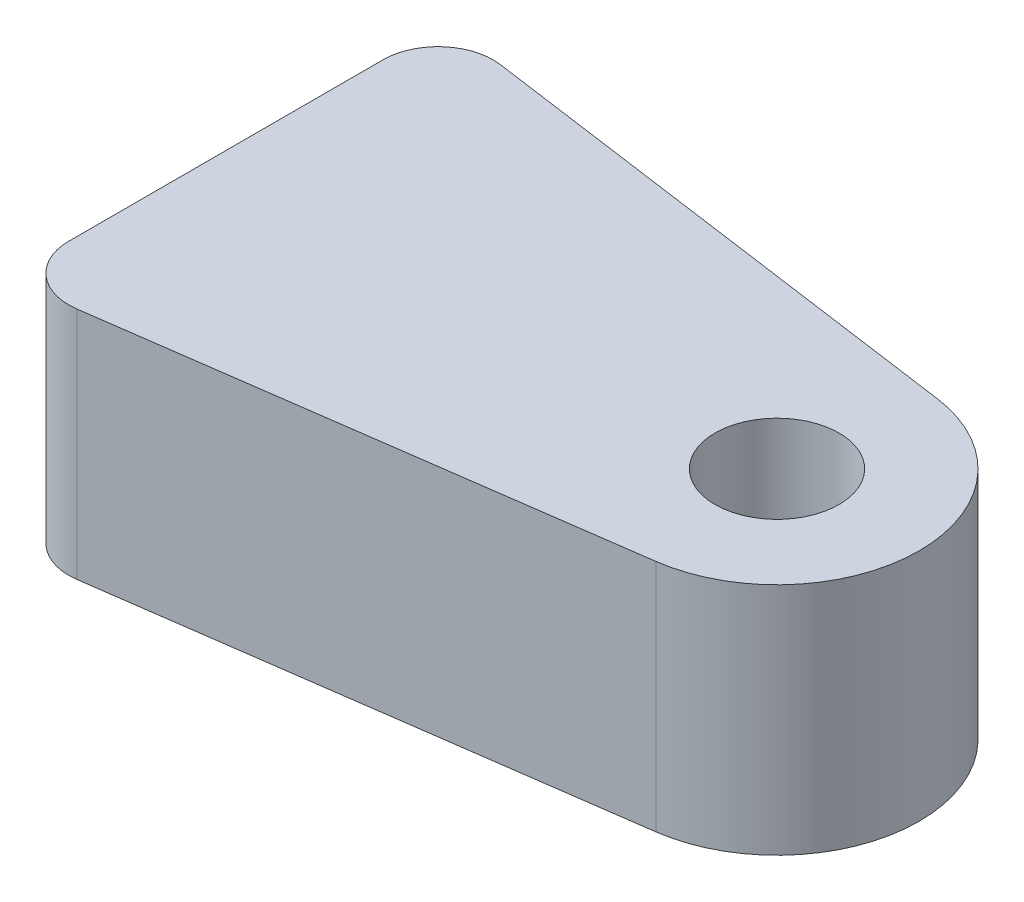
from build123d import *

# Parameters (mm, degrees)
ESQUISSE1_R             = 5.158029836
ESQUISSE1_R_2           = 2.45
BOSS_EXTRU_1_DEPTH      = 2.5
ESQUISSE2_R             = 5.158029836
ESQUISSE2_R_2           = 1
BOSS_EXTRU_2_DEPTH      = 6
ESQUISSE3_R             = 2.25
ENL_V_MAT_EXTRU_1_DEPTH = 4.5
BOSS_EXTRU_3_DEPTH      = 8.5
CONG_1_R                = 2


with BuildPart() as part:
    # Esquisse1 → Boss.-Extru.1 (new body)
    with BuildSketch(Plane(origin=(0, 0, 0), x_dir=(1, 0, 0), z_dir=(0, 1, 0))):
        with Locations(Location((0, 0, 0), (0, 0, 270))):
            Circle(ESQUISSE1_R)
        with Locations(Location((0, 0, 0), (0, 0, 270))):
            Circle(ESQUISSE1_R_2, mode=Mode.SUBTRACT)
    extrude(amount=BOSS_EXTRU_1_DEPTH)

    # Esquisse2 → Boss.-Extru.2 (add)
    with BuildSketch(Plane(origin=(0, 2.5, 0), x_dir=(1, 0, 0), z_dir=(0, 1, 0))):
        with Locations(Location((0, 0, 0), (0, 0, 270))):
            Circle(ESQUISSE2_R)
        with Locations(Location((0, 0, 0), (0, 0, 270))):
            Circle(ESQUISSE2_R_2, mode=Mode.SUBTRACT)
    extrude(amount=BOSS_EXTRU_2_DEPTH)

    # Esquisse3 → Enl_v. mat.-Extru.1 (cut)
    with BuildSketch(Plane(origin=(0, 8.5, 0), x_dir=(1, 0, 0), z_dir=(0, 1, 0))):
        with Locations(Location((0, 0, 0), (0, 0, 270))):
            Circle(ESQUISSE3_R)
    extrude(amount=-ENL_V_MAT_EXTRU_1_DEPTH, mode=Mode.SUBTRACT)

    # Esquisse4 → Boss.-Extru.3 (add)
    with BuildSketch(Plane(origin=(0, 0, 0), x_dir=(1, 0, 0), z_dir=(0, 1, 0))):
        Polygon((0.713134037, 5.108494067), (-20, 8), (-20, -8), (0.713134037, -5.108494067), (-2.684753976, -2.73597438), (-2.684753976, 1.689272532), align=None)
    extrude(amount=BOSS_EXTRU_3_DEPTH)

    # Cong_1
    cong_1_edges = [part.edges().sort_by_distance(p)[0] for p in [
        (-20, 4.25, -8),
        (-20, 4.25, 8),
    ]]
    fillet(cong_1_edges, radius=CONG_1_R)


solid = part.part
